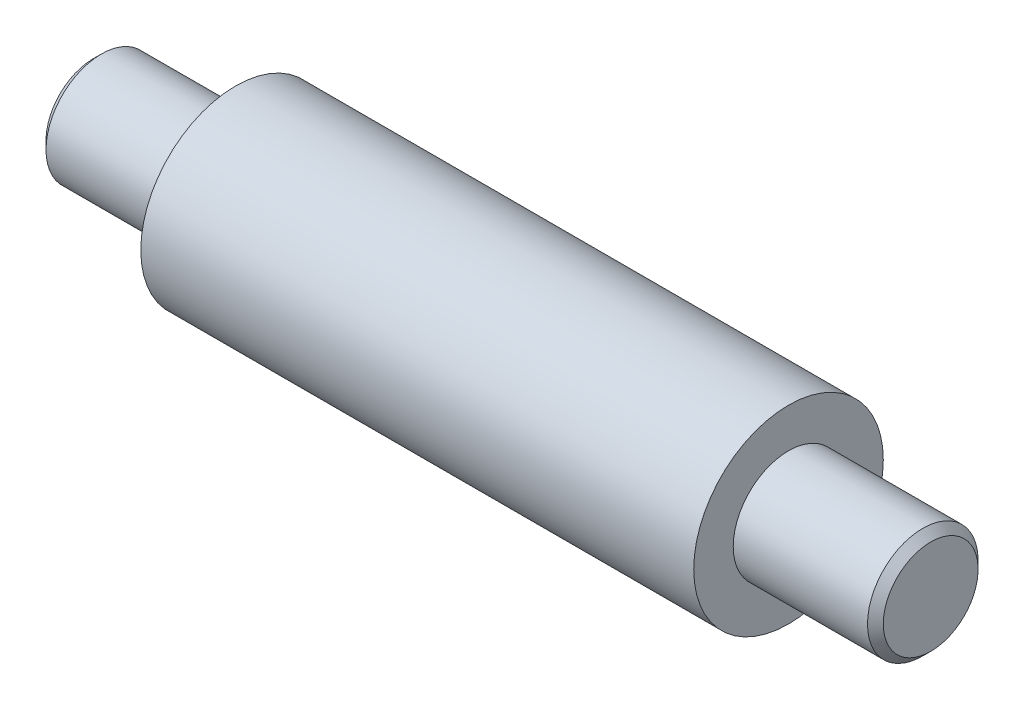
from build123d import *

# Parameters (mm, degrees)
CHAMFER1_SIZE = 1


with BuildPart() as part:
    # Sketch1 → Revolve1 (revolve)
    with BuildSketch(Plane.XY, mode=Mode.PRIVATE) as revolve1_sk:
        Polygon((0, 0), (106, 0), (106, 7), (88, 7), (88, 12), (18, 12), (18, 7), (0, 7), align=None)
    revolve(revolve1_sk.sketch.rotate(Axis((0, 0, 0), (1, 0, 0)), 90), axis=Axis((0, 0, 0), (1, 0, 0)))

    # Chamfer1
    chamfer1_edges = [part.edges().sort_by_distance(p)[0] for p in [
        (0, 0, -7),
        (106, 0, -7),
    ]]
    chamfer(chamfer1_edges, length=CHAMFER1_SIZE)


solid = part.part
